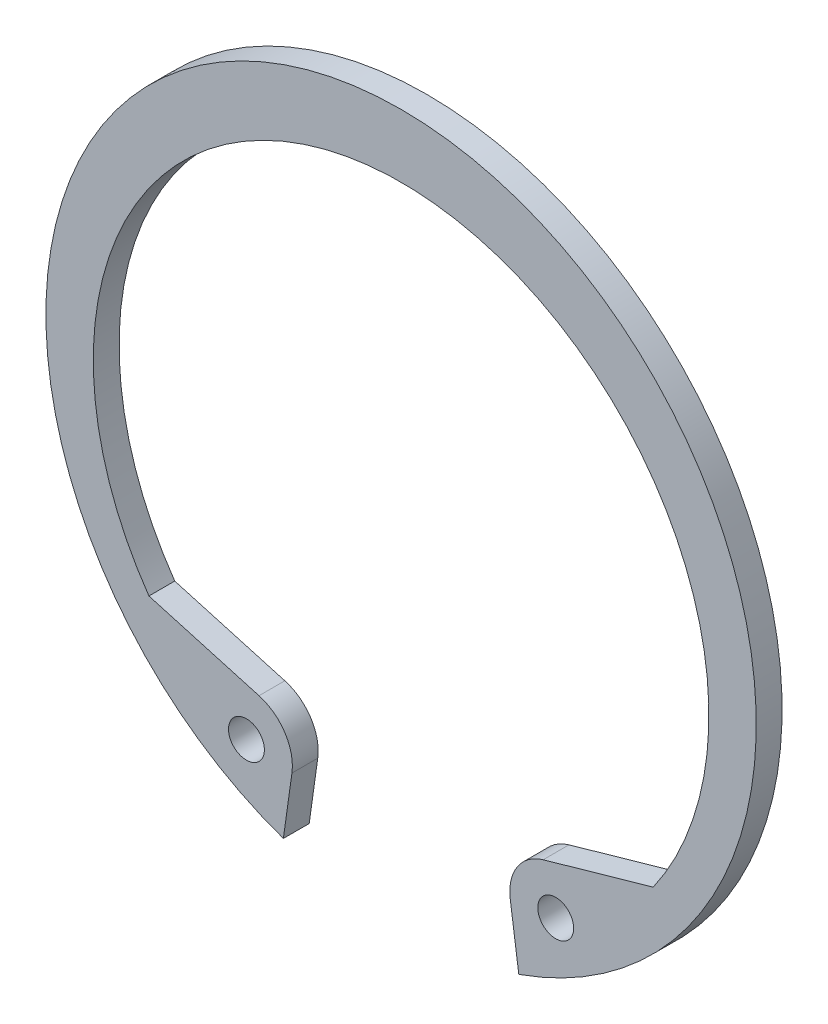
ISO-10303-21;
HEADER;
FILE_DESCRIPTION(('STEP AP214'),'2;1');
FILE_NAME('part.step','',(''),(''),'','','');
FILE_SCHEMA(('AUTOMOTIVE_DESIGN { 1 0 10303 214 1 1 1 1 }'));
ENDSEC;
DATA;
#1=APPLICATION_CONTEXT('core data for automotive mechanical design processes');
#2=APPLICATION_PROTOCOL_DEFINITION('international standard','automotive_design',2000,#1);
#3=PRODUCT_CONTEXT('',#1,'mechanical');
#4=PRODUCT('Part','Part','',(#3));
#5=PRODUCT_RELATED_PRODUCT_CATEGORY('part','',(#4));
#6=PRODUCT_DEFINITION_FORMATION('','',#4);
#7=PRODUCT_DEFINITION_CONTEXT('part definition',#1,'design');
#8=PRODUCT_DEFINITION('design','',#6,#7);
#9=PRODUCT_DEFINITION_SHAPE('','',#8);
#10=(LENGTH_UNIT() NAMED_UNIT(*) SI_UNIT(.MILLI.,.METRE.));
#11=(NAMED_UNIT(*) PLANE_ANGLE_UNIT() SI_UNIT($,.RADIAN.));
#12=(NAMED_UNIT(*) SI_UNIT($,.STERADIAN.) SOLID_ANGLE_UNIT());
#13=UNCERTAINTY_MEASURE_WITH_UNIT(LENGTH_MEASURE(1.E-05),#10,'distance_accuracy_value','');
#14=(GEOMETRIC_REPRESENTATION_CONTEXT(3) GLOBAL_UNCERTAINTY_ASSIGNED_CONTEXT((#13)) GLOBAL_UNIT_ASSIGNED_CONTEXT((#10,
#11,#12)) REPRESENTATION_CONTEXT('',''));
#15=CARTESIAN_POINT('',(0.,0.,0.));
#16=DIRECTION('',(0.,0.,1.));
#17=DIRECTION('',(1.,0.,0.));
#18=AXIS2_PLACEMENT_3D('',#15,#16,#17);
#19=CARTESIAN_POINT('',(-9.89963048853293,-15.5849052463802,1.8));
#20=DIRECTION('',(-0.273552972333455,-0.961856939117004,0.));
#21=DIRECTION('',(0.961856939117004,-0.273552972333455,0.));
#22=AXIS2_PLACEMENT_3D('',#19,#20,#21);
#23=PLANE('',#22);
#24=DIRECTION('',(-0.961856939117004,0.273552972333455,0.));
#25=VECTOR('',#24,1.);
#26=CARTESIAN_POINT('',(-9.89963048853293,-15.5849052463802,0.));
#27=LINE('',#26,#25);
#28=CARTESIAN_POINT('',(-9.89963048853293,-15.5849052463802,0.));
#29=VERTEX_POINT('',#28);
#30=CARTESIAN_POINT('',(-17.5708113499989,-13.4032145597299,0.));
#31=VERTEX_POINT('',#30);
#32=EDGE_CURVE('E97',#29,#31,#27,.T.);
#33=ORIENTED_EDGE('',*,*,#32,.T.);
#34=DIRECTION('',(0.,0.,-1.));
#35=VECTOR('',#34,1.);
#36=CARTESIAN_POINT('',(-17.5708113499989,-13.4032145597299,1.8));
#37=LINE('',#36,#35);
#38=CARTESIAN_POINT('',(-17.5708113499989,-13.4032145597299,1.8));
#39=VERTEX_POINT('',#38);
#40=EDGE_CURVE('E11',#39,#31,#37,.T.);
#41=ORIENTED_EDGE('',*,*,#40,.F.);
#42=DIRECTION('',(-0.961856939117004,0.273552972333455,0.));
#43=VECTOR('',#42,1.);
#44=CARTESIAN_POINT('',(-9.89963048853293,-15.5849052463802,1.8));
#45=LINE('',#44,#43);
#46=CARTESIAN_POINT('',(-9.89963048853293,-15.5849052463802,1.8));
#47=VERTEX_POINT('',#46);
#48=EDGE_CURVE('E117',#47,#39,#45,.T.);
#49=ORIENTED_EDGE('',*,*,#48,.F.);
#50=DIRECTION('',(0.,0.,-1.));
#51=VECTOR('',#50,1.);
#52=CARTESIAN_POINT('',(-9.89963048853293,-15.5849052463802,1.8));
#53=LINE('',#52,#51);
#54=EDGE_CURVE('E132',#47,#29,#53,.T.);
#55=ORIENTED_EDGE('',*,*,#54,.T.);
#56=EDGE_LOOP('',(#33,#41,#49,#55));
#57=FACE_BOUND('',#56,.T.);
#58=ADVANCED_FACE('F16',(#57),#23,.F.);
#59=CARTESIAN_POINT('',(0.,-1.09999999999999,1.8));
#60=DIRECTION('',(0.,0.,-1.));
#61=DIRECTION('',(-1.,0.,0.));
#62=AXIS2_PLACEMENT_3D('',#59,#60,#61);
#63=CYLINDRICAL_SURFACE('',#62,21.45);
#64=CARTESIAN_POINT('',(0.,-1.09999999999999,0.));
#65=DIRECTION('',(0.,0.,1.));
#66=DIRECTION('',(1.,0.,0.));
#67=AXIS2_PLACEMENT_3D('',#64,#65,#66);
#68=CIRCLE('',#67,21.45);
#69=CARTESIAN_POINT('',(17.5708113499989,-13.4032145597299,0.));
#70=VERTEX_POINT('',#69);
#71=EDGE_CURVE('E91',#70,#31,#68,.T.);
#72=ORIENTED_EDGE('',*,*,#71,.F.);
#73=DIRECTION('',(0.,0.,-1.));
#74=VECTOR('',#73,1.);
#75=CARTESIAN_POINT('',(17.5708113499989,-13.4032145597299,1.8));
#76=LINE('',#75,#74);
#77=CARTESIAN_POINT('',(17.5708113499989,-13.4032145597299,1.8));
#78=VERTEX_POINT('',#77);
#79=EDGE_CURVE('E19',#78,#70,#76,.T.);
#80=ORIENTED_EDGE('',*,*,#79,.F.);
#81=CARTESIAN_POINT('',(0.,-1.09999999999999,1.8));
#82=DIRECTION('',(0.,0.,1.));
#83=DIRECTION('',(1.,0.,0.));
#84=AXIS2_PLACEMENT_3D('',#81,#82,#83);
#85=CIRCLE('',#84,21.45);
#86=EDGE_CURVE('E120',#78,#39,#85,.T.);
#87=ORIENTED_EDGE('',*,*,#86,.T.);
#88=ORIENTED_EDGE('',*,*,#40,.T.);
#89=EDGE_LOOP('',(#72,#80,#87,#88));
#90=FACE_BOUND('',#89,.T.);
#91=ADVANCED_FACE('F92',(#90),#63,.F.);
#92=CARTESIAN_POINT('',(9.89963048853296,-15.5849052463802,1.8));
#93=DIRECTION('',(-0.273552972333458,0.961856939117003,0.));
#94=DIRECTION('',(-0.961856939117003,-0.273552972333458,0.));
#95=AXIS2_PLACEMENT_3D('',#92,#93,#94);
#96=PLANE('',#95);
#97=DIRECTION('',(0.961856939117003,0.273552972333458,0.));
#98=VECTOR('',#97,1.);
#99=CARTESIAN_POINT('',(9.89963048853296,-15.5849052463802,0.));
#100=LINE('',#99,#98);
#101=CARTESIAN_POINT('',(9.89963048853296,-15.5849052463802,0.));
#102=VERTEX_POINT('',#101);
#103=EDGE_CURVE('E83',#102,#70,#100,.T.);
#104=ORIENTED_EDGE('',*,*,#103,.F.);
#105=DIRECTION('',(0.,0.,-1.));
#106=VECTOR('',#105,1.);
#107=CARTESIAN_POINT('',(9.89963048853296,-15.5849052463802,1.8));
#108=LINE('',#107,#106);
#109=CARTESIAN_POINT('',(9.89963048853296,-15.5849052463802,1.8));
#110=VERTEX_POINT('',#109);
#111=EDGE_CURVE('E89',#110,#102,#108,.T.);
#112=ORIENTED_EDGE('',*,*,#111,.F.);
#113=DIRECTION('',(0.961856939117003,0.273552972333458,0.));
#114=VECTOR('',#113,1.);
#115=CARTESIAN_POINT('',(9.89963048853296,-15.5849052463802,1.8));
#116=LINE('',#115,#114);
#117=EDGE_CURVE('E85',#110,#78,#116,.T.);
#118=ORIENTED_EDGE('',*,*,#117,.T.);
#119=ORIENTED_EDGE('',*,*,#79,.T.);
#120=EDGE_LOOP('',(#104,#112,#118,#119));
#121=FACE_BOUND('',#120,.T.);
#122=ADVANCED_FACE('F81',(#121),#96,.T.);
#123=CARTESIAN_POINT('',(10.775,-18.6628474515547,1.8));
#124=DIRECTION('',(0.,0.,-1.));
#125=DIRECTION('',(-1.,0.,0.));
#126=AXIS2_PLACEMENT_3D('',#123,#124,#125);
#127=CYLINDRICAL_SURFACE('',#126,3.2);
#128=CARTESIAN_POINT('',(10.775,-18.6628474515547,0.));
#129=DIRECTION('',(0.,0.,1.));
#130=DIRECTION('',(1.,0.,0.));
#131=AXIS2_PLACEMENT_3D('',#128,#129,#130);
#132=CIRCLE('',#131,3.2);
#133=CARTESIAN_POINT('',(7.60614218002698,-19.1082013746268,0.));
#134=VERTEX_POINT('',#133);
#135=EDGE_CURVE('E102',#102,#134,#132,.T.);
#136=ORIENTED_EDGE('',*,*,#135,.T.);
#137=DIRECTION('',(0.,0.,-1.));
#138=VECTOR('',#137,1.);
#139=CARTESIAN_POINT('',(7.60614218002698,-19.1082013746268,1.8));
#140=LINE('',#139,#138);
#141=CARTESIAN_POINT('',(7.60614218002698,-19.1082013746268,1.8));
#142=VERTEX_POINT('',#141);
#143=EDGE_CURVE('E142',#142,#134,#140,.T.);
#144=ORIENTED_EDGE('',*,*,#143,.F.);
#145=CARTESIAN_POINT('',(10.775,-18.6628474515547,1.8));
#146=DIRECTION('',(0.,0.,1.));
#147=DIRECTION('',(1.,0.,0.));
#148=AXIS2_PLACEMENT_3D('',#145,#146,#147);
#149=CIRCLE('',#148,3.2);
#150=EDGE_CURVE('E123',#110,#142,#149,.T.);
#151=ORIENTED_EDGE('',*,*,#150,.F.);
#152=ORIENTED_EDGE('',*,*,#111,.T.);
#153=EDGE_LOOP('',(#136,#144,#151,#152));
#154=FACE_BOUND('',#153,.T.);
#155=ADVANCED_FACE('F147',(#154),#127,.T.);
#156=CARTESIAN_POINT('',(7.60614218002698,-19.1082013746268,1.8));
#157=DIRECTION('',(0.99026806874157,0.139173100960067,0.));
#158=DIRECTION('',(-0.139173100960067,0.99026806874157,0.));
#159=AXIS2_PLACEMENT_3D('',#156,#157,#158);
#160=PLANE('',#159);
#161=DIRECTION('',(0.139173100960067,-0.99026806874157,0.));
#162=VECTOR('',#161,1.);
#163=CARTESIAN_POINT('',(7.60614218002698,-19.1082013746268,0.));
#164=LINE('',#163,#162);
#165=CARTESIAN_POINT('',(8.20246724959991,-23.3512747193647,0.));
#166=VERTEX_POINT('',#165);
#167=EDGE_CURVE('E104',#134,#166,#164,.T.);
#168=ORIENTED_EDGE('',*,*,#167,.T.);
#169=DIRECTION('',(0.,0.,-1.));
#170=VECTOR('',#169,1.);
#171=CARTESIAN_POINT('',(8.20246724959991,-23.3512747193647,1.8));
#172=LINE('',#171,#170);
#173=CARTESIAN_POINT('',(8.20246724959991,-23.3512747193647,1.8));
#174=VERTEX_POINT('',#173);
#175=EDGE_CURVE('E139',#174,#166,#172,.T.);
#176=ORIENTED_EDGE('',*,*,#175,.F.);
#177=DIRECTION('',(0.139173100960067,-0.99026806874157,0.));
#178=VECTOR('',#177,1.);
#179=CARTESIAN_POINT('',(7.60614218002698,-19.1082013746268,1.8));
#180=LINE('',#179,#178);
#181=EDGE_CURVE('E125',#142,#174,#180,.T.);
#182=ORIENTED_EDGE('',*,*,#181,.F.);
#183=ORIENTED_EDGE('',*,*,#143,.T.);
#184=EDGE_LOOP('',(#168,#176,#182,#183));
#185=FACE_BOUND('',#184,.T.);
#186=ADVANCED_FACE('F163',(#185),#160,.F.);
#187=CARTESIAN_POINT('',(0.,0.,1.8));
#188=DIRECTION('',(0.,0.,-1.));
#189=DIRECTION('',(-1.,0.,0.));
#190=AXIS2_PLACEMENT_3D('',#187,#188,#189);
#191=CYLINDRICAL_SURFACE('',#190,24.75);
#192=CARTESIAN_POINT('',(0.,0.,0.));
#193=DIRECTION('',(0.,0.,1.));
#194=DIRECTION('',(1.,0.,0.));
#195=AXIS2_PLACEMENT_3D('',#192,#193,#194);
#196=CIRCLE('',#195,24.75);
#197=CARTESIAN_POINT('',(-8.20246724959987,-23.3512747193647,0.));
#198=VERTEX_POINT('',#197);
#199=EDGE_CURVE('E109',#166,#198,#196,.T.);
#200=ORIENTED_EDGE('',*,*,#199,.T.);
#201=DIRECTION('',(0.,0.,-1.));
#202=VECTOR('',#201,1.);
#203=CARTESIAN_POINT('',(-8.20246724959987,-23.3512747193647,1.8));
#204=LINE('',#203,#202);
#205=CARTESIAN_POINT('',(-8.20246724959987,-23.3512747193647,1.8));
#206=VERTEX_POINT('',#205);
#207=EDGE_CURVE('E137',#206,#198,#204,.T.);
#208=ORIENTED_EDGE('',*,*,#207,.F.);
#209=CARTESIAN_POINT('',(0.,0.,1.8));
#210=DIRECTION('',(0.,0.,1.));
#211=DIRECTION('',(1.,0.,0.));
#212=AXIS2_PLACEMENT_3D('',#209,#210,#211);
#213=CIRCLE('',#212,24.75);
#214=EDGE_CURVE('E127',#174,#206,#213,.T.);
#215=ORIENTED_EDGE('',*,*,#214,.F.);
#216=ORIENTED_EDGE('',*,*,#175,.T.);
#217=EDGE_LOOP('',(#200,#208,#215,#216));
#218=FACE_BOUND('',#217,.T.);
#219=ADVANCED_FACE('F160',(#218),#191,.T.);
#220=CARTESIAN_POINT('',(-7.60614218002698,-19.1082013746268,1.8));
#221=DIRECTION('',(0.99026806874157,-0.139173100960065,0.));
#222=DIRECTION('',(0.139173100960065,0.99026806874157,0.));
#223=AXIS2_PLACEMENT_3D('',#220,#221,#222);
#224=PLANE('',#223);
#225=DIRECTION('',(-0.139173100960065,-0.99026806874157,0.));
#226=VECTOR('',#225,1.);
#227=CARTESIAN_POINT('',(-7.60614218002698,-19.1082013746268,0.));
#228=LINE('',#227,#226);
#229=CARTESIAN_POINT('',(-7.60614218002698,-19.1082013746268,0.));
#230=VERTEX_POINT('',#229);
#231=EDGE_CURVE('E112',#230,#198,#228,.T.);
#232=ORIENTED_EDGE('',*,*,#231,.F.);
#233=DIRECTION('',(0.,0.,-1.));
#234=VECTOR('',#233,1.);
#235=CARTESIAN_POINT('',(-7.60614218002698,-19.1082013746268,1.8));
#236=LINE('',#235,#234);
#237=CARTESIAN_POINT('',(-7.60614218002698,-19.1082013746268,1.8));
#238=VERTEX_POINT('',#237);
#239=EDGE_CURVE('E38',#238,#230,#236,.T.);
#240=ORIENTED_EDGE('',*,*,#239,.F.);
#241=DIRECTION('',(-0.139173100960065,-0.99026806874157,0.));
#242=VECTOR('',#241,1.);
#243=CARTESIAN_POINT('',(-7.60614218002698,-19.1082013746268,1.8));
#244=LINE('',#243,#242);
#245=EDGE_CURVE('E129',#238,#206,#244,.T.);
#246=ORIENTED_EDGE('',*,*,#245,.T.);
#247=ORIENTED_EDGE('',*,*,#207,.T.);
#248=EDGE_LOOP('',(#232,#240,#246,#247));
#249=FACE_BOUND('',#248,.T.);
#250=ADVANCED_FACE('F156',(#249),#224,.T.);
#251=CARTESIAN_POINT('',(-10.775,-18.6628474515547,1.8));
#252=DIRECTION('',(0.,0.,-1.));
#253=DIRECTION('',(-1.,0.,0.));
#254=AXIS2_PLACEMENT_3D('',#251,#252,#253);
#255=CYLINDRICAL_SURFACE('',#254,3.2);
#256=CARTESIAN_POINT('',(-10.775,-18.6628474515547,0.));
#257=DIRECTION('',(0.,0.,1.));
#258=DIRECTION('',(1.,0.,0.));
#259=AXIS2_PLACEMENT_3D('',#256,#257,#258);
#260=CIRCLE('',#259,3.2);
#261=EDGE_CURVE('E115',#230,#29,#260,.T.);
#262=ORIENTED_EDGE('',*,*,#261,.T.);
#263=ORIENTED_EDGE('',*,*,#54,.F.);
#264=CARTESIAN_POINT('',(-10.775,-18.6628474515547,1.8));
#265=DIRECTION('',(0.,0.,1.));
#266=DIRECTION('',(1.,0.,0.));
#267=AXIS2_PLACEMENT_3D('',#264,#265,#266);
#268=CIRCLE('',#267,3.2);
#269=EDGE_CURVE('E30',#238,#47,#268,.T.);
#270=ORIENTED_EDGE('',*,*,#269,.F.);
#271=ORIENTED_EDGE('',*,*,#239,.T.);
#272=EDGE_LOOP('',(#262,#263,#270,#271));
#273=FACE_BOUND('',#272,.T.);
#274=ADVANCED_FACE('F190',(#273),#255,.T.);
#275=CARTESIAN_POINT('',(0.,-1.09999999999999,1.8));
#276=DIRECTION('',(0.,0.,1.));
#277=DIRECTION('',(1.,0.,0.));
#278=AXIS2_PLACEMENT_3D('',#275,#276,#277);
#279=PLANE('',#278);
#280=CARTESIAN_POINT('',(10.775,-18.6628474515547,1.8));
#281=DIRECTION('',(0.,0.,-1.));
#282=DIRECTION('',(0.,1.,0.));
#283=AXIS2_PLACEMENT_3D('',#280,#281,#282);
#284=CIRCLE('',#283,1.25);
#285=CARTESIAN_POINT('',(10.775,-17.4128474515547,1.8));
#286=VERTEX_POINT('',#285);
#287=EDGE_CURVE('E211',#286,#286,#284,.T.);
#288=ORIENTED_EDGE('',*,*,#287,.T.);
#289=EDGE_LOOP('',(#288));
#290=FACE_BOUND('',#289,.T.);
#291=CARTESIAN_POINT('',(-10.775,-18.6628474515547,1.8));
#292=DIRECTION('',(0.,0.,-1.));
#293=DIRECTION('',(0.,1.,0.));
#294=AXIS2_PLACEMENT_3D('',#291,#292,#293);
#295=CIRCLE('',#294,1.25);
#296=CARTESIAN_POINT('',(-10.775,-17.4128474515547,1.8));
#297=VERTEX_POINT('',#296);
#298=EDGE_CURVE('E119',#297,#297,#295,.T.);
#299=ORIENTED_EDGE('',*,*,#298,.T.);
#300=EDGE_LOOP('',(#299));
#301=FACE_BOUND('',#300,.T.);
#302=ORIENTED_EDGE('',*,*,#48,.T.);
#303=ORIENTED_EDGE('',*,*,#86,.F.);
#304=ORIENTED_EDGE('',*,*,#117,.F.);
#305=ORIENTED_EDGE('',*,*,#150,.T.);
#306=ORIENTED_EDGE('',*,*,#181,.T.);
#307=ORIENTED_EDGE('',*,*,#214,.T.);
#308=ORIENTED_EDGE('',*,*,#245,.F.);
#309=ORIENTED_EDGE('',*,*,#269,.T.);
#310=EDGE_LOOP('',(#302,#303,#304,#305,#306,#307,#308,#309));
#311=FACE_BOUND('',#310,.T.);
#312=ADVANCED_FACE('F150',(#290,#301,#311),#279,.T.);
#313=CARTESIAN_POINT('',(0.,-1.09999999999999,0.));
#314=DIRECTION('',(0.,0.,1.));
#315=DIRECTION('',(1.,0.,0.));
#316=AXIS2_PLACEMENT_3D('',#313,#314,#315);
#317=PLANE('',#316);
#318=CARTESIAN_POINT('',(10.775,-18.6628474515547,0.));
#319=DIRECTION('',(0.,0.,1.));
#320=DIRECTION('',(0.,1.,0.));
#321=AXIS2_PLACEMENT_3D('',#318,#319,#320);
#322=CIRCLE('',#321,1.25);
#323=CARTESIAN_POINT('',(10.775,-17.4128474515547,0.));
#324=VERTEX_POINT('',#323);
#325=EDGE_CURVE('E214',#324,#324,#322,.T.);
#326=ORIENTED_EDGE('',*,*,#325,.T.);
#327=EDGE_LOOP('',(#326));
#328=FACE_BOUND('',#327,.T.);
#329=CARTESIAN_POINT('',(-10.775,-18.6628474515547,0.));
#330=DIRECTION('',(0.,0.,1.));
#331=DIRECTION('',(0.,1.,0.));
#332=AXIS2_PLACEMENT_3D('',#329,#330,#331);
#333=CIRCLE('',#332,1.25);
#334=CARTESIAN_POINT('',(-10.775,-17.4128474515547,0.));
#335=VERTEX_POINT('',#334);
#336=EDGE_CURVE('E216',#335,#335,#333,.T.);
#337=ORIENTED_EDGE('',*,*,#336,.T.);
#338=EDGE_LOOP('',(#337));
#339=FACE_BOUND('',#338,.T.);
#340=ORIENTED_EDGE('',*,*,#32,.F.);
#341=ORIENTED_EDGE('',*,*,#261,.F.);
#342=ORIENTED_EDGE('',*,*,#231,.T.);
#343=ORIENTED_EDGE('',*,*,#199,.F.);
#344=ORIENTED_EDGE('',*,*,#167,.F.);
#345=ORIENTED_EDGE('',*,*,#135,.F.);
#346=ORIENTED_EDGE('',*,*,#103,.T.);
#347=ORIENTED_EDGE('',*,*,#71,.T.);
#348=EDGE_LOOP('',(#340,#341,#342,#343,#344,#345,#346,#347));
#349=FACE_BOUND('',#348,.T.);
#350=ADVANCED_FACE('F100',(#328,#339,#349),#317,.F.);
#351=CARTESIAN_POINT('',(-10.775,-18.6628474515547,0.));
#352=DIRECTION('',(0.,0.,1.));
#353=DIRECTION('',(0.,1.,0.));
#354=AXIS2_PLACEMENT_3D('',#351,#352,#353);
#355=CYLINDRICAL_SURFACE('',#354,1.25);
#356=ORIENTED_EDGE('',*,*,#298,.F.);
#357=EDGE_LOOP('',(#356));
#358=FACE_BOUND('',#357,.T.);
#359=ORIENTED_EDGE('',*,*,#336,.F.);
#360=EDGE_LOOP('',(#359));
#361=FACE_BOUND('',#360,.T.);
#362=ADVANCED_FACE('F198',(#358,#361),#355,.F.);
#363=CARTESIAN_POINT('',(10.775,-18.6628474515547,0.));
#364=DIRECTION('',(0.,0.,1.));
#365=DIRECTION('',(0.,1.,0.));
#366=AXIS2_PLACEMENT_3D('',#363,#364,#365);
#367=CYLINDRICAL_SURFACE('',#366,1.25);
#368=ORIENTED_EDGE('',*,*,#287,.F.);
#369=EDGE_LOOP('',(#368));
#370=FACE_BOUND('',#369,.T.);
#371=ORIENTED_EDGE('',*,*,#325,.F.);
#372=EDGE_LOOP('',(#371));
#373=FACE_BOUND('',#372,.T.);
#374=ADVANCED_FACE('F202',(#370,#373),#367,.F.);
#375=CLOSED_SHELL('',(#58,#91,#122,#155,#186,#219,#250,#274,#312,#350,#362,#374));
#376=MANIFOLD_SOLID_BREP('B1',#375);
#377=ADVANCED_BREP_SHAPE_REPRESENTATION('',(#18,#376),#14);
#378=SHAPE_DEFINITION_REPRESENTATION(#9,#377);
ENDSEC;
END-ISO-10303-21;
